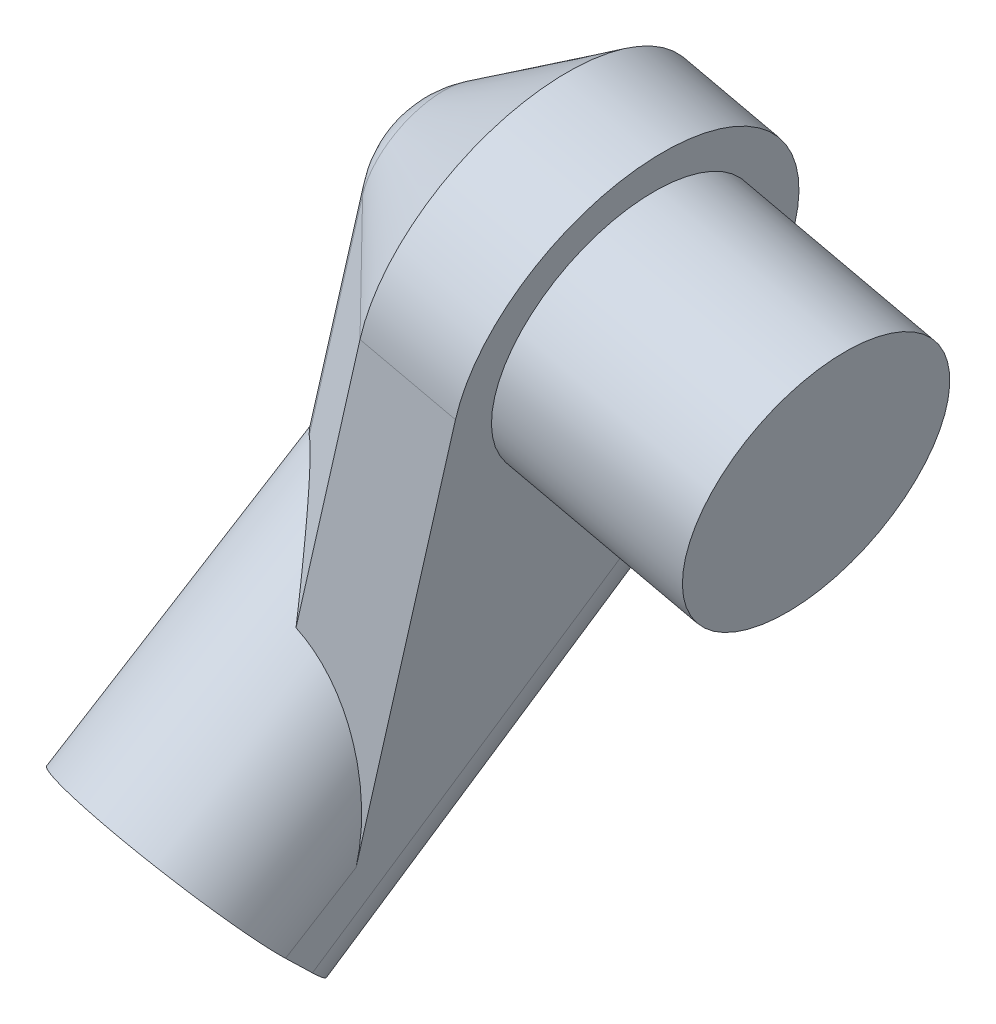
ISO-10303-21;
HEADER;
FILE_DESCRIPTION(('STEP AP214'),'2;1');
FILE_NAME('part.step','',(''),(''),'','','');
FILE_SCHEMA(('AUTOMOTIVE_DESIGN { 1 0 10303 214 1 1 1 1 }'));
ENDSEC;
DATA;
#1=APPLICATION_CONTEXT('core data for automotive mechanical design processes');
#2=APPLICATION_PROTOCOL_DEFINITION('international standard','automotive_design',2000,#1);
#3=PRODUCT_CONTEXT('',#1,'mechanical');
#4=PRODUCT('Part','Part','',(#3));
#5=PRODUCT_RELATED_PRODUCT_CATEGORY('part','',(#4));
#6=PRODUCT_DEFINITION_FORMATION('','',#4);
#7=PRODUCT_DEFINITION_CONTEXT('part definition',#1,'design');
#8=PRODUCT_DEFINITION('design','',#6,#7);
#9=PRODUCT_DEFINITION_SHAPE('','',#8);
#10=(LENGTH_UNIT() NAMED_UNIT(*) SI_UNIT(.MILLI.,.METRE.));
#11=(NAMED_UNIT(*) PLANE_ANGLE_UNIT() SI_UNIT($,.RADIAN.));
#12=(NAMED_UNIT(*) SI_UNIT($,.STERADIAN.) SOLID_ANGLE_UNIT());
#13=UNCERTAINTY_MEASURE_WITH_UNIT(LENGTH_MEASURE(1.E-05),#10,'distance_accuracy_value','');
#14=(GEOMETRIC_REPRESENTATION_CONTEXT(3) GLOBAL_UNCERTAINTY_ASSIGNED_CONTEXT((#13)) GLOBAL_UNIT_ASSIGNED_CONTEXT((#10,
#11,#12)) REPRESENTATION_CONTEXT('',''));
#15=CARTESIAN_POINT('',(0.,0.,0.));
#16=DIRECTION('',(0.,0.,1.));
#17=DIRECTION('',(1.,0.,0.));
#18=AXIS2_PLACEMENT_3D('',#15,#16,#17);
#19=CARTESIAN_POINT('',(-4.30807873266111,20.8127531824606,-0.811195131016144));
#20=DIRECTION('',(-0.156712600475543,-0.689522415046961,0.707106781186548));
#21=DIRECTION('',(0.975131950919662,-0.221625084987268,0.));
#22=AXIS2_PLACEMENT_3D('',#19,#20,#21);
#23=PLANE('',#22);
#24=CARTESIAN_POINT('',(-4.30807873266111,20.8127531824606,-0.811195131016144));
#25=DIRECTION('',(-0.156712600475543,-0.689522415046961,0.707106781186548));
#26=DIRECTION('',(0.156712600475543,0.689522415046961,0.707106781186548));
#27=AXIS2_PLACEMENT_3D('',#24,#25,#26);
#28=CIRCLE('',#27,1.1);
#29=CARTESIAN_POINT('',(-4.13569487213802,21.5712278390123,-0.0333776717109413));
#30=VERTEX_POINT('',#29);
#31=EDGE_CURVE('E256',#30,#30,#28,.T.);
#32=ORIENTED_EDGE('',*,*,#31,.T.);
#33=EDGE_LOOP('',(#32));
#34=FACE_BOUND('',#33,.T.);
#35=ADVANCED_FACE('F17',(#34),#23,.T.);
#36=CARTESIAN_POINT('',(-2.65023585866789,21.7318780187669,-2.13659409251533));
#37=DIRECTION('',(-0.680150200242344,-0.475634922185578,0.557823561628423));
#38=DIRECTION('',(0.573082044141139,-0.819497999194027,0.));
#39=AXIS2_PLACEMENT_3D('',#36,#37,#38);
#40=CYLINDRICAL_SURFACE('',#39,1.5);
#41=CARTESIAN_POINT('',(-5.7262300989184,20.5391610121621,-1.52275017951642));
#42=CARTESIAN_POINT('',(-5.66126643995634,20.3194183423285,-1.6347988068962));
#43=CARTESIAN_POINT('',(-5.55005027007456,20.0901685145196,-1.70019833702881));
#44=CARTESIAN_POINT('',(-5.26277710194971,19.6694235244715,-1.72165114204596));
#45=CARTESIAN_POINT('',(-5.08714943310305,19.4785571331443,-1.67767238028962));
#46=CARTESIAN_POINT('',(-4.90124973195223,19.3308812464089,-1.58435754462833));
#47=(BOUNDED_CURVE() B_SPLINE_CURVE(3,(#41,#42,#43,#44,#45,#46),.UNSPECIFIED.,.F.,
.F.) B_SPLINE_CURVE_WITH_KNOTS((4,2,4),(6.83423118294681,7.34410640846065,7.85398163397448),
.UNSPECIFIED.) CURVE() GEOMETRIC_REPRESENTATION_ITEM() RATIONAL_B_SPLINE_CURVE((1.,1.,1.,1.,1.,1.)) REPRESENTATION_ITEM(''));
#48=CARTESIAN_POINT('',(-4.90124973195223,19.3308812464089,-1.58435754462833));
#49=VERTEX_POINT('',#48);
#50=CARTESIAN_POINT('',(-5.72623009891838,20.539161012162,-1.52275017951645));
#51=VERTEX_POINT('',#50);
#52=EDGE_CURVE('E28',#49,#51,#47,.F.);
#53=ORIENTED_EDGE('',*,*,#52,.T.);
#54=DIRECTION('',(-0.680150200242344,-0.475634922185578,0.557823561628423));
#55=VECTOR('',#54,1.);
#56=CARTESIAN_POINT('',(-3.93211517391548,21.7938011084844,-2.99418924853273));
#57=LINE('',#56,#55);
#58=CARTESIAN_POINT('',(-3.80919735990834,21.8797585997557,-3.095));
#59=VERTEX_POINT('',#58);
#60=EDGE_CURVE('E595',#59,#51,#57,.T.);
#61=ORIENTED_EDGE('',*,*,#60,.F.);
#62=CARTESIAN_POINT('',(-3.54481478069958,20.8524743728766,-3.095));
#63=CARTESIAN_POINT('',(-3.81638535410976,21.0880790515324,-3.095));
#64=CARTESIAN_POINT('',(-3.90811810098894,21.4445155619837,-3.095));
#65=CARTESIAN_POINT('',(-3.80919735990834,21.8797585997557,-3.095));
#66=(BOUNDED_CURVE() B_SPLINE_CURVE(3,(#62,#63,#64,#65),.UNSPECIFIED.,.F.,
.F.) B_SPLINE_CURVE_WITH_KNOTS((4,4),(6.1440687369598,6.83423118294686),
.UNSPECIFIED.) CURVE() GEOMETRIC_REPRESENTATION_ITEM() RATIONAL_B_SPLINE_CURVE((1.,
0.960698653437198,0.960698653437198,1.)) REPRESENTATION_ITEM(''));
#67=CARTESIAN_POINT('',(-3.54481478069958,20.8524743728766,-3.095));
#68=VERTEX_POINT('',#67);
#69=EDGE_CURVE('E236',#68,#59,#66,.T.);
#70=ORIENTED_EDGE('',*,*,#69,.F.);
#71=CARTESIAN_POINT('',(-3.54481478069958,20.8524743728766,-3.095));
#72=CARTESIAN_POINT('',(-3.78985761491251,20.4810584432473,-2.78931375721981));
#73=CARTESIAN_POINT('',(-4.04105594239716,20.1126435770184,-2.44936253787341));
#74=CARTESIAN_POINT('',(-4.2916033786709,19.7572122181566,-2.08435754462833));
#75=(BOUNDED_CURVE() B_SPLINE_CURVE(3,(#71,#72,#73,#74),.UNSPECIFIED.,.F.,
.F.) B_SPLINE_CURVE_WITH_KNOTS((4,4),(1.24120832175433,1.5707963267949),
.UNSPECIFIED.) CURVE() GEOMETRIC_REPRESENTATION_ITEM() RATIONAL_B_SPLINE_CURVE((1.,
0.990968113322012,0.990968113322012,1.)) REPRESENTATION_ITEM(''));
#76=CARTESIAN_POINT('',(-4.2916033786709,19.7572122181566,-2.08435754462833));
#77=VERTEX_POINT('',#76);
#78=EDGE_CURVE('E11',#68,#77,#75,.T.);
#79=ORIENTED_EDGE('',*,*,#78,.T.);
#80=DIRECTION('',(0.680150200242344,0.475634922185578,-0.557823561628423));
#81=VECTOR('',#80,1.);
#82=CARTESIAN_POINT('',(-2.87367028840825,20.748785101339,-3.2472719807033));
#83=LINE('',#82,#81);
#84=EDGE_CURVE('E310',#49,#77,#83,.T.);
#85=ORIENTED_EDGE('',*,*,#84,.F.);
#86=EDGE_LOOP('',(#53,#61,#70,#79,#85));
#87=FACE_BOUND('',#86,.T.);
#88=ADVANCED_FACE('F322',(#87),#40,.T.);
#89=CARTESIAN_POINT('',(-3.8214097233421,21.8260252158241,-1.98432211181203));
#90=DIRECTION('',(0.16410272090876,0.722038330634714,-0.672109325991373));
#91=DIRECTION('',(-0.148956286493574,-0.655395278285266,-0.740451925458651));
#92=AXIS2_PLACEMENT_3D('',#89,#90,#91);
#93=CYLINDRICAL_SURFACE('',#92,1.5);
#94=CARTESIAN_POINT('',(-5.14183235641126,16.0162753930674,1.39789321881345));
#95=CARTESIAN_POINT('',(-4.28500374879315,15.8215379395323,1.39789321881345));
#96=CARTESIAN_POINT('',(-3.58165180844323,16.11275319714,1.83774695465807));
#97=CARTESIAN_POINT('',(-3.44379056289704,16.7193312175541,2.45979407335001));
#98=(BOUNDED_CURVE() B_SPLINE_CURVE(3,(#94,#95,#96,#97),.UNSPECIFIED.,.F.,
.F.) B_SPLINE_CURVE_WITH_KNOTS((4,4),(3.1415926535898,4.71238898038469),
.UNSPECIFIED.) CURVE() GEOMETRIC_REPRESENTATION_ITEM() RATIONAL_B_SPLINE_CURVE((1.,
0.804737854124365,0.804737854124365,1.)) REPRESENTATION_ITEM(''));
#99=CARTESIAN_POINT('',(-5.14183235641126,16.0162753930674,1.39789321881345));
#100=VERTEX_POINT('',#99);
#101=CARTESIAN_POINT('',(-3.44379056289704,16.7193312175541,2.45979407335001));
#102=VERTEX_POINT('',#101);
#103=EDGE_CURVE('E267',#100,#102,#98,.T.);
#104=ORIENTED_EDGE('',*,*,#103,.F.);
#105=DIRECTION('',(-0.16410272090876,-0.722038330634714,0.672109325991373));
#106=VECTOR('',#105,1.);
#107=CARTESIAN_POINT('',(-5.14183235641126,16.0162753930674,1.39789321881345));
#108=LINE('',#107,#106);
#109=EDGE_CURVE('E543',#77,#100,#108,.T.);
#110=ORIENTED_EDGE('',*,*,#109,.F.);
#111=ORIENTED_EDGE('',*,*,#78,.F.);
#112=CARTESIAN_POINT('',(-2.08752784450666,22.686774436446,-3.095));
#113=CARTESIAN_POINT('',(-2.30650603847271,21.7232885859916,-3.095));
#114=CARTESIAN_POINT('',(-2.86122879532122,21.0250541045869,-3.095));
#115=CARTESIAN_POINT('',(-3.54481478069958,20.8524743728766,-3.095));
#116=(BOUNDED_CURVE() B_SPLINE_CURVE(3,(#112,#113,#114,#115),.UNSPECIFIED.,.F.,
.F.) B_SPLINE_CURVE_WITH_KNOTS((4,4),(1.5707963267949,2.81200464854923),
.UNSPECIFIED.) CURVE() GEOMETRIC_REPRESENTATION_ITEM() RATIONAL_B_SPLINE_CURVE((1.,
0.875684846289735,0.875684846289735,1.)) REPRESENTATION_ITEM(''));
#117=CARTESIAN_POINT('',(-2.08752784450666,22.686774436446,-3.095));
#118=VERTEX_POINT('',#117);
#119=EDGE_CURVE('E231',#118,#68,#116,.T.);
#120=ORIENTED_EDGE('',*,*,#119,.F.);
#121=DIRECTION('',(0.16410272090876,0.722038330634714,-0.672109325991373));
#122=VECTOR('',#121,1.);
#123=CARTESIAN_POINT('',(-2.35871179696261,21.4935875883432,-1.98432211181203));
#124=LINE('',#123,#122);
#125=EDGE_CURVE('E214',#102,#118,#124,.T.);
#126=ORIENTED_EDGE('',*,*,#125,.F.);
#127=EDGE_LOOP('',(#104,#110,#111,#120,#126));
#128=FACE_BOUND('',#127,.T.);
#129=ADVANCED_FACE('F19',(#128),#93,.T.);
#130=CARTESIAN_POINT('',(-5.7262300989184,20.5391610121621,-1.52275017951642));
#131=CARTESIAN_POINT('',(-5.95654152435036,20.3184309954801,-1.34708545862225));
#132=CARTESIAN_POINT('',(-6.03757685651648,20.0974785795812,-1.06917091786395));
#133=CARTESIAN_POINT('',(-5.66126643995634,20.3194183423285,-1.6347988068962));
#134=CARTESIAN_POINT('',(-5.85406110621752,20.1103337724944,-1.47937973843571));
#135=CARTESIAN_POINT('',(-5.94007789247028,19.923891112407,-1.228617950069));
#136=CARTESIAN_POINT('',(-5.55005027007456,20.0901685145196,-1.70019833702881));
#137=CARTESIAN_POINT('',(-5.6966543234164,19.9118025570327,-1.56465625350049));
#138=CARTESIAN_POINT('',(-5.78261834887,19.7602430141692,-1.36138620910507));
#139=CARTESIAN_POINT('',(-5.26277710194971,19.6694235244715,-1.72165114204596));
#140=CARTESIAN_POINT('',(-5.32873003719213,19.5748799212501,-1.64019051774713));
#141=CARTESIAN_POINT('',(-5.38692857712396,19.4932998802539,-1.54078356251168));
#142=CARTESIAN_POINT('',(-5.08714943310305,19.4785571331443,-1.67767238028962));
#143=CARTESIAN_POINT('',(-5.11778244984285,19.4342716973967,-1.63231170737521));
#144=CARTESIAN_POINT('',(-5.14928970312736,19.3904037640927,-1.58714457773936));
#145=CARTESIAN_POINT('',(-4.90124973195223,19.3308812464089,-1.58435754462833));
#146=CARTESIAN_POINT('',(-4.90124973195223,19.3308812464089,-1.58435754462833));
#147=CARTESIAN_POINT('',(-4.90124973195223,19.3308812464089,-1.58435754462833));
#148=(BOUNDED_SURFACE() B_SPLINE_SURFACE(3,2,((#130,#131,#132),(#133,#134,#135),(#136,#137,
#138),(#139,#140,#141),(#142,#143,#144),(#145,#146,#147)),.UNSPECIFIED.,.F.,.F.,
.F.) B_SPLINE_SURFACE_WITH_KNOTS((4,2,4),(3,3),(6.83423118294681,7.34410640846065,
7.85398163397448),(0.,1.),
.UNSPECIFIED.) GEOMETRIC_REPRESENTATION_ITEM() RATIONAL_B_SPLINE_SURFACE(((1.,0.968652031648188,
1.),(1.,0.97531957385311,1.),(1.,0.983603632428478,1.),(1.,0.996040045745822,1.),(1.,
1.00010066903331,1.),(1.,1.,1.))) REPRESENTATION_ITEM('') SURFACE());
#149=CARTESIAN_POINT('',(-4.90124973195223,19.3308812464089,-1.58435754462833));
#150=CARTESIAN_POINT('',(-5.14928970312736,19.3904037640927,-1.58714457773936));
#151=CARTESIAN_POINT('',(-5.38692857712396,19.4932998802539,-1.54078356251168));
#152=CARTESIAN_POINT('',(-5.78261834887,19.7602430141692,-1.36138620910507));
#153=CARTESIAN_POINT('',(-5.94007789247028,19.923891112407,-1.228617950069));
#154=CARTESIAN_POINT('',(-6.03757685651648,20.0974785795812,-1.06917091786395));
#155=(BOUNDED_CURVE() B_SPLINE_CURVE(3,(#149,#150,#151,#152,#153,#154),.UNSPECIFIED.,.F.,
.F.) B_SPLINE_CURVE_WITH_KNOTS((4,2,4),(6.83423118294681,7.34410640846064,7.85398163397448),
.UNSPECIFIED.) CURVE() GEOMETRIC_REPRESENTATION_ITEM() RATIONAL_B_SPLINE_CURVE((1.,1.,1.,1.,1.,1.)) REPRESENTATION_ITEM(''));
#156=CARTESIAN_POINT('',(-6.03757685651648,20.0974785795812,-1.06917091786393));
#157=VERTEX_POINT('',#156);
#158=EDGE_CURVE('E43',#49,#157,#155,.T.);
#159=CARTESIAN_POINT('',(-4.7471082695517,20.3166291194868,-0.518658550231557));
#160=DIRECTION('',(0.352992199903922,-0.779789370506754,-0.517034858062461));
#161=DIRECTION('',(0.911006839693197,0.412391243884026,0.));
#162=AXIS2_PLACEMENT_3D('',#159,#160,#161);
#163=CIRCLE('',#162,1.42);
#164=EDGE_CURVE('E623',#157,#51,#163,.T.);
#165=ORIENTED_EDGE('',*,*,#158,.T.);
#166=ORIENTED_EDGE('',*,*,#164,.T.);
#167=ORIENTED_EDGE('',*,*,#52,.F.);
#168=EDGE_LOOP('',(#165,#166,#167));
#169=FACE_BOUND('',#168,.T.);
#170=ADVANCED_FACE('F354',(#169),#148,.T.);
#171=CARTESIAN_POINT('',(-4.06109784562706,23.0274797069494,-2.99954608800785));
#172=DIRECTION('',(-0.16410272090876,-0.722038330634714,0.672109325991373));
#173=DIRECTION('',(0.148956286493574,0.655395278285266,0.740451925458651));
#174=AXIS2_PLACEMENT_3D('',#171,#172,#173);
#175=CYLINDRICAL_SURFACE('',#174,1.5);
#176=DIRECTION('',(-0.16410272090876,-0.722038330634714,0.672109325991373));
#177=VECTOR('',#176,1.);
#178=CARTESIAN_POINT('',(-5.52379577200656,23.3599173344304,-2.99954608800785));
#179=LINE('',#178,#177);
#180=CARTESIAN_POINT('',(-6.13242245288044,20.682010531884,-0.506816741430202));
#181=VERTEX_POINT('',#180);
#182=CARTESIAN_POINT('',(-6.85675239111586,17.4950190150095,2.45979407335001));
#183=VERTEX_POINT('',#182);
#184=EDGE_CURVE('E477',#181,#183,#179,.T.);
#185=ORIENTED_EDGE('',*,*,#184,.F.);
#186=CARTESIAN_POINT('',(-6.03757685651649,20.0974785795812,-1.06917091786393));
#187=CARTESIAN_POINT('',(-6.14309994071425,20.2853522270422,-0.896601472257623));
#188=CARTESIAN_POINT('',(-6.17620457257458,20.4893728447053,-0.700321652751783));
#189=CARTESIAN_POINT('',(-6.13242245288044,20.682010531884,-0.506816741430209));
#190=(BOUNDED_CURVE() B_SPLINE_CURVE(3,(#186,#187,#188,#189),.UNSPECIFIED.,.F.,
.F.) B_SPLINE_CURVE_WITH_KNOTS((4,4),(5.64582302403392,6.19686889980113),
.UNSPECIFIED.) CURVE() GEOMETRIC_REPRESENTATION_ITEM() RATIONAL_B_SPLINE_CURVE((1.,1.,1.,1.)) REPRESENTATION_ITEM(''));
#191=EDGE_CURVE('E164',#181,#157,#190,.F.);
#192=ORIENTED_EDGE('',*,*,#191,.T.);
#193=ORIENTED_EDGE('',*,*,#158,.F.);
#194=DIRECTION('',(0.16410272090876,0.722038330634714,-0.672109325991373));
#195=VECTOR('',#194,1.);
#196=CARTESIAN_POINT('',(-4.53241012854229,20.9537448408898,-3.095));
#197=LINE('',#196,#195);
#198=CARTESIAN_POINT('',(-5.62939833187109,16.1270879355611,1.39789321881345));
#199=VERTEX_POINT('',#198);
#200=EDGE_CURVE('E237',#199,#49,#197,.T.);
#201=ORIENTED_EDGE('',*,*,#200,.F.);
#202=CARTESIAN_POINT('',(-6.85675239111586,17.4950190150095,2.45979407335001));
#203=CARTESIAN_POINT('',(-6.99461363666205,16.8884409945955,1.83774695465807));
#204=CARTESIAN_POINT('',(-6.48622693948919,16.3218253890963,1.39789321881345));
#205=CARTESIAN_POINT('',(-5.62939833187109,16.1270879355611,1.39789321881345));
#206=(BOUNDED_CURVE() B_SPLINE_CURVE(3,(#202,#203,#204,#205),.UNSPECIFIED.,.F.,
.F.) B_SPLINE_CURVE_WITH_KNOTS((4,4),(4.71238898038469,6.28318530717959),
.UNSPECIFIED.) CURVE() GEOMETRIC_REPRESENTATION_ITEM() RATIONAL_B_SPLINE_CURVE((1.,
0.804737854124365,0.804737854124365,1.)) REPRESENTATION_ITEM(''));
#207=EDGE_CURVE('E271',#183,#199,#206,.T.);
#208=ORIENTED_EDGE('',*,*,#207,.F.);
#209=EDGE_LOOP('',(#185,#192,#193,#201,#208));
#210=FACE_BOUND('',#209,.T.);
#211=ADVANCED_FACE('F359',(#210),#175,.T.);
#212=CARTESIAN_POINT('',(-5.7268569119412,20.5898348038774,-1.5109083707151));
#213=CARTESIAN_POINT('',(-6.13242245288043,20.682010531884,-1.095));
#214=CARTESIAN_POINT('',(-6.13242245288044,20.682010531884,-0.506816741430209));
#215=CARTESIAN_POINT('',(-5.73171908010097,20.5684416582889,-1.51090837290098));
#216=CARTESIAN_POINT('',(-6.08343588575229,20.5467376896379,-1.17274822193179));
#217=CARTESIAN_POINT('',(-6.17620457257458,20.4893728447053,-0.700321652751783));
#218=CARTESIAN_POINT('',(-5.73149629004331,20.5507944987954,-1.51503667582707));
#219=CARTESIAN_POINT('',(-6.02435022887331,20.4241802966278,-1.25752632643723));
#220=CARTESIAN_POINT('',(-6.14309994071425,20.2853522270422,-0.896601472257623));
#221=CARTESIAN_POINT('',(-5.72623009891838,20.539161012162,-1.52275017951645));
#222=CARTESIAN_POINT('',(-5.95654152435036,20.3184309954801,-1.34708545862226));
#223=CARTESIAN_POINT('',(-6.03757685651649,20.0974785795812,-1.06917091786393));
#224=(BOUNDED_SURFACE() B_SPLINE_SURFACE(3,2,((#212,#213,#214),(#215,#216,#217),(#218,#219,
#220),(#221,#222,#223)),.UNSPECIFIED.,.F.,.F.,.F.) B_SPLINE_SURFACE_WITH_KNOTS((4,4),(3,3),
(5.64582302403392,6.19686889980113),(0.,1.),
.UNSPECIFIED.) GEOMETRIC_REPRESENTATION_ITEM() RATIONAL_B_SPLINE_SURFACE(((1.,0.923879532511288,
1.),(1.,0.949922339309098,1.),(1.,0.965074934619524,1.),(1.,0.968652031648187,1.))) REPRESENTATION_ITEM('') SURFACE());
#225=CARTESIAN_POINT('',(-4.74773508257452,20.3673029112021,-0.506816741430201));
#226=DIRECTION('',(0.221625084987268,0.975131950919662,0.));
#227=DIRECTION('',(-0.975131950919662,0.221625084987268,0.));
#228=AXIS2_PLACEMENT_3D('',#225,#226,#227);
#229=CIRCLE('',#228,1.42);
#230=CARTESIAN_POINT('',(-5.7268569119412,20.5898348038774,-1.5109083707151));
#231=VERTEX_POINT('',#230);
#232=EDGE_CURVE('E294',#231,#181,#229,.T.);
#233=CARTESIAN_POINT('',(-5.72623009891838,20.539161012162,-1.52275017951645));
#234=CARTESIAN_POINT('',(-5.73155038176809,20.5509139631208,-1.51495745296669));
#235=CARTESIAN_POINT('',(-5.73176470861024,20.5682409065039,-1.5109083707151));
#236=CARTESIAN_POINT('',(-5.7268569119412,20.5898348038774,-1.5109083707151));
#237=(BOUNDED_CURVE() B_SPLINE_CURVE(3,(#233,#234,#235,#236),.UNSPECIFIED.,.F.,
.F.) B_SPLINE_CURVE_WITH_KNOTS((4,4),(0.0863164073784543,0.63736228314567),
.UNSPECIFIED.) CURVE() GEOMETRIC_REPRESENTATION_ITEM() RATIONAL_B_SPLINE_CURVE((1.,
0.974855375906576,0.974855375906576,1.)) REPRESENTATION_ITEM(''));
#238=EDGE_CURVE('E295',#51,#231,#237,.T.);
#239=ORIENTED_EDGE('',*,*,#191,.F.);
#240=ORIENTED_EDGE('',*,*,#232,.F.);
#241=ORIENTED_EDGE('',*,*,#238,.F.);
#242=ORIENTED_EDGE('',*,*,#164,.F.);
#243=EDGE_LOOP('',(#239,#240,#241,#242));
#244=FACE_BOUND('',#243,.T.);
#245=ADVANCED_FACE('F396',(#244),#224,.T.);
#246=CARTESIAN_POINT('',(-3.63527031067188,25.2620554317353,-0.483183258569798));
#247=DIRECTION('',(-0.221625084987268,-0.975131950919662,0.));
#248=DIRECTION('',(0.975131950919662,-0.221625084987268,0.));
#249=AXIS2_PLACEMENT_3D('',#246,#247,#248);
#250=CYLINDRICAL_SURFACE('',#249,1.42);
#251=CARTESIAN_POINT('',(-5.43198830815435,21.8872321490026,0.5209083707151));
#252=CARTESIAN_POINT('',(-5.44900288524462,21.8807514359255,0.505752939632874));
#253=CARTESIAN_POINT('',(-5.46567081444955,21.8741032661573,0.49028078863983));
#254=CARTESIAN_POINT('',(-5.49882342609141,21.8602511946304,0.458235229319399));
#255=CARTESIAN_POINT('',(-5.51528472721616,21.8530362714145,0.441642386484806));
#256=CARTESIAN_POINT('',(-5.54793622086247,21.8380159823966,0.407341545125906));
#257=CARTESIAN_POINT('',(-5.56410153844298,21.8301991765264,0.389614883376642));
#258=CARTESIAN_POINT('',(-5.59606778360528,21.813943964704,0.353035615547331));
#259=CARTESIAN_POINT('',(-5.61184231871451,21.8054938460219,0.334165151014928));
#260=CARTESIAN_POINT('',(-5.64292798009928,21.7879439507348,0.295291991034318));
#261=CARTESIAN_POINT('',(-5.65821116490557,21.7788323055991,0.275272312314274));
#262=CARTESIAN_POINT('',(-5.68820995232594,21.7599342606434,0.234099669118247));
#263=CARTESIAN_POINT('',(-5.70289605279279,21.7501359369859,0.212930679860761));
#264=CARTESIAN_POINT('',(-5.73159007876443,21.7298468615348,0.169462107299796));
#265=CARTESIAN_POINT('',(-5.74556689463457,21.7193443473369,0.147147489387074));
#266=CARTESIAN_POINT('',(-5.77273123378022,21.6976217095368,0.101402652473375));
#267=CARTESIAN_POINT('',(-5.7858861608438,21.6863897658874,0.0779586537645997));
#268=CARTESIAN_POINT('',(-5.80641069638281,21.6676715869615,0.0391471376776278));
#269=CARTESIAN_POINT('',(-5.8141535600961,21.6602979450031,0.023921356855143));
#270=CARTESIAN_POINT('',(-5.83001175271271,21.6445107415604,-0.0085260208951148));
#271=CARTESIAN_POINT('',(-5.83806214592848,21.6360776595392,-0.0257699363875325));
#272=CARTESIAN_POINT('',(-5.85433928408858,21.6180928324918,-0.0622806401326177));
#273=CARTESIAN_POINT('',(-5.86249402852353,21.6085173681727,-0.0815678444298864));
#274=CARTESIAN_POINT('',(-5.87875531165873,21.5881764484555,-0.122190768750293));
#275=CARTESIAN_POINT('',(-5.88678209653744,21.5773849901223,-0.143545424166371));
#276=CARTESIAN_POINT('',(-5.90253649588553,21.5545417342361,-0.188317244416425));
#277=CARTESIAN_POINT('',(-5.91017633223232,21.5424623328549,-0.211751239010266));
#278=CARTESIAN_POINT('',(-5.92487822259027,21.5169805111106,-0.26068304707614));
#279=CARTESIAN_POINT('',(-5.93184418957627,21.5035498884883,-0.28619507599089));
#280=CARTESIAN_POINT('',(-5.94489218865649,21.4753132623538,-0.339266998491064));
#281=CARTESIAN_POINT('',(-5.95086963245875,21.4604793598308,-0.366837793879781));
#282=CARTESIAN_POINT('',(-5.96160860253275,21.4294002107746,-0.423990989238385));
#283=CARTESIAN_POINT('',(-5.96625701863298,21.4131284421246,-0.453580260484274));
#284=CARTESIAN_POINT('',(-5.96999582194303,21.3966742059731,-0.483183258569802));
#285=B_SPLINE_CURVE_WITH_KNOTS('',3,(#251,#252,#253,#254,#255,#256,#257,#258,#259,#260,#261,
#262,#263,#264,#265,#266,#267,#268,#269,#270,#271,#272,#273,#274,#275,#276,#277,#278,#279,#280,
#281,#282,#283,#284),.UNSPECIFIED.,.F.,.F.,(4,2,2,2,2,2,2,2,2,2,2,2,2,2,2,2,4),(0.,
0.0710619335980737,0.14442327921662,0.220095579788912,0.298089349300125,0.378414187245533,
0.461078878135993,0.546091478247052,0.633459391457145,0.689266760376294,0.751700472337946,
0.82076192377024,0.896452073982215,0.978771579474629,1.06772087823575,1.16330024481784,
1.2655098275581),.UNSPECIFIED.);
#286=CARTESIAN_POINT('',(-5.43198830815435,21.8872321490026,0.520908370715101));
#287=VERTEX_POINT('',#286);
#288=CARTESIAN_POINT('',(-5.96999582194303,21.3966742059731,-0.483183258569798));
#289=VERTEX_POINT('',#288);
#290=EDGE_CURVE('E150',#287,#289,#285,.T.);
#291=ORIENTED_EDGE('',*,*,#290,.F.);
#292=DIRECTION('',(-0.221625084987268,-0.975131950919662,0.));
#293=VECTOR('',#292,1.);
#294=CARTESIAN_POINT('',(-4.61439214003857,25.4845873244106,0.520908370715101));
#295=LINE('',#294,#293);
#296=CARTESIAN_POINT('',(-4.61439214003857,25.4845873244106,0.520908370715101));
#297=VERTEX_POINT('',#296);
#298=EDGE_CURVE('E251',#297,#287,#295,.T.);
#299=ORIENTED_EDGE('',*,*,#298,.F.);
#300=CARTESIAN_POINT('',(-3.63527031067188,25.2620554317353,-0.483183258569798));
#301=DIRECTION('',(-0.221625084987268,-0.975131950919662,0.));
#302=DIRECTION('',(0.975131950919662,-0.221625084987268,0.));
#303=AXIS2_PLACEMENT_3D('',#300,#301,#302);
#304=CIRCLE('',#303,1.42);
#305=CARTESIAN_POINT('',(-5.0199576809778,25.5767630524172,-0.483183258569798));
#306=VERTEX_POINT('',#305);
#307=EDGE_CURVE('E296',#297,#306,#304,.T.);
#308=ORIENTED_EDGE('',*,*,#307,.T.);
#309=DIRECTION('',(0.221625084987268,0.975131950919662,0.));
#310=VECTOR('',#309,1.);
#311=CARTESIAN_POINT('',(-5.0199576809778,25.5767630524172,-0.483183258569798));
#312=LINE('',#311,#310);
#313=EDGE_CURVE('E246',#289,#306,#312,.T.);
#314=ORIENTED_EDGE('',*,*,#313,.F.);
#315=EDGE_LOOP('',(#291,#299,#308,#314));
#316=FACE_BOUND('',#315,.T.);
#317=ADVANCED_FACE('F332',(#316),#250,.T.);
#318=CARTESIAN_POINT('',(-3.63527031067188,25.2620554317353,-0.495));
#319=DIRECTION('',(-0.975131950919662,0.221625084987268,0.));
#320=DIRECTION('',(0.,0.,1.));
#321=AXIS2_PLACEMENT_3D('',#318,#319,#320);
#322=DEGENERATE_TOROIDAL_SURFACE('',#321,0.0118167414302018,1.42,.T.);
#323=CARTESIAN_POINT('',(-3.63527031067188,25.2620554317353,-0.506816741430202));
#324=DIRECTION('',(0.221625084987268,0.975131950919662,0.));
#325=DIRECTION('',(-0.975131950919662,0.221625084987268,0.));
#326=AXIS2_PLACEMENT_3D('',#323,#324,#325);
#327=CIRCLE('',#326,1.42);
#328=CARTESIAN_POINT('',(-4.61439214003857,25.4845873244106,-1.5109083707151));
#329=VERTEX_POINT('',#328);
#330=CARTESIAN_POINT('',(-5.0199576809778,25.5767630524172,-0.506816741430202));
#331=VERTEX_POINT('',#330);
#332=EDGE_CURVE('E298',#329,#331,#327,.T.);
#333=ORIENTED_EDGE('',*,*,#332,.T.);
#334=CARTESIAN_POINT('',(-5.0199576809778,25.5767630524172,-0.495));
#335=DIRECTION('',(-0.975131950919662,0.221625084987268,0.));
#336=DIRECTION('',(0.,0.,1.));
#337=AXIS2_PLACEMENT_3D('',#334,#335,#336);
#338=CIRCLE('',#337,0.0118167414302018);
#339=EDGE_CURVE('E238',#306,#331,#338,.T.);
#340=ORIENTED_EDGE('',*,*,#339,.F.);
#341=ORIENTED_EDGE('',*,*,#307,.F.);
#342=CARTESIAN_POINT('',(-4.61439214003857,25.4845873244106,-0.495));
#343=DIRECTION('',(0.975131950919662,-0.221625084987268,0.));
#344=DIRECTION('',(0.,0.,1.));
#345=AXIS2_PLACEMENT_3D('',#342,#343,#344);
#346=CIRCLE('',#345,1.0159083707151);
#347=EDGE_CURVE('E250',#329,#297,#346,.T.);
#348=ORIENTED_EDGE('',*,*,#347,.F.);
#349=EDGE_LOOP('',(#333,#340,#341,#348));
#350=FACE_BOUND('',#349,.T.);
#351=ADVANCED_FACE('F346',(#350),#322,.T.);
#352=CARTESIAN_POINT('',(-3.63527031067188,25.2620554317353,-0.506816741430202));
#353=DIRECTION('',(0.221625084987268,0.975131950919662,0.));
#354=DIRECTION('',(0.,0.,-1.));
#355=AXIS2_PLACEMENT_3D('',#352,#353,#354);
#356=CYLINDRICAL_SURFACE('',#355,1.42);
#357=DIRECTION('',(0.221625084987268,0.975131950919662,0.));
#358=VECTOR('',#357,1.);
#359=CARTESIAN_POINT('',(-4.61439214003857,25.4845873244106,-1.5109083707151));
#360=LINE('',#359,#358);
#361=EDGE_CURVE('E290',#231,#329,#360,.T.);
#362=ORIENTED_EDGE('',*,*,#361,.F.);
#363=ORIENTED_EDGE('',*,*,#232,.T.);
#364=DIRECTION('',(-0.221625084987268,-0.975131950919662,0.));
#365=VECTOR('',#364,1.);
#366=CARTESIAN_POINT('',(-5.0199576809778,25.5767630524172,-0.506816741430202));
#367=LINE('',#366,#365);
#368=EDGE_CURVE('E289',#331,#181,#367,.T.);
#369=ORIENTED_EDGE('',*,*,#368,.F.);
#370=ORIENTED_EDGE('',*,*,#332,.F.);
#371=EDGE_LOOP('',(#362,#363,#369,#370));
#372=FACE_BOUND('',#371,.T.);
#373=ADVANCED_FACE('F349',(#372),#356,.T.);
#374=CARTESIAN_POINT('',(-5.0199576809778,25.5767630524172,-1.095));
#375=DIRECTION('',(0.68952241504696,-0.156712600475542,0.707106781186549));
#376=DIRECTION('',(-0.221625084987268,-0.975131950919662,0.));
#377=AXIS2_PLACEMENT_3D('',#374,#375,#376);
#378=PLANE('',#377);
#379=DIRECTION('',(0.221625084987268,0.975131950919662,0.));
#380=VECTOR('',#379,1.);
#381=CARTESIAN_POINT('',(-3.06969377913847,25.1335128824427,-3.095));
#382=LINE('',#381,#380);
#383=CARTESIAN_POINT('',(-3.06969377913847,25.1335128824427,-3.095));
#384=VERTEX_POINT('',#383);
#385=EDGE_CURVE('E192',#59,#384,#382,.T.);
#386=ORIENTED_EDGE('',*,*,#385,.F.);
#387=ORIENTED_EDGE('',*,*,#60,.T.);
#388=ORIENTED_EDGE('',*,*,#238,.T.);
#389=ORIENTED_EDGE('',*,*,#361,.T.);
#390=DIRECTION('',(0.689522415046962,-0.156712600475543,-0.707106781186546));
#391=VECTOR('',#390,1.);
#392=CARTESIAN_POINT('',(-5.0199576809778,25.5767630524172,-1.095));
#393=LINE('',#392,#391);
#394=EDGE_CURVE('E247',#329,#384,#393,.T.);
#395=ORIENTED_EDGE('',*,*,#394,.T.);
#396=EDGE_LOOP('',(#386,#387,#388,#389,#395));
#397=FACE_BOUND('',#396,.T.);
#398=ADVANCED_FACE('F352',(#397),#378,.F.);
#399=CARTESIAN_POINT('',(-5.0199576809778,25.5767630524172,-0.495));
#400=DIRECTION('',(0.975131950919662,-0.221625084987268,0.));
#401=DIRECTION('',(0.,0.,-1.));
#402=AXIS2_PLACEMENT_3D('',#399,#400,#401);
#403=CONICAL_SURFACE('',#402,0.6,0.785398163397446);
#404=ORIENTED_EDGE('',*,*,#394,.F.);
#405=ORIENTED_EDGE('',*,*,#347,.T.);
#406=DIRECTION('',(0.689522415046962,-0.156712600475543,0.707106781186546));
#407=VECTOR('',#406,1.);
#408=CARTESIAN_POINT('',(-5.0199576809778,25.5767630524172,0.104999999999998));
#409=LINE('',#408,#407);
#410=CARTESIAN_POINT('',(-3.06969377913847,25.1335128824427,2.105));
#411=VERTEX_POINT('',#410);
#412=EDGE_CURVE('E458',#297,#411,#409,.T.);
#413=ORIENTED_EDGE('',*,*,#412,.T.);
#414=CARTESIAN_POINT('',(-3.06969377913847,25.1335128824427,-0.495));
#415=DIRECTION('',(0.975131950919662,-0.221625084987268,0.));
#416=DIRECTION('',(0.,0.,1.));
#417=AXIS2_PLACEMENT_3D('',#414,#415,#416);
#418=CIRCLE('',#417,2.6);
#419=EDGE_CURVE('E197',#384,#411,#418,.T.);
#420=ORIENTED_EDGE('',*,*,#419,.F.);
#421=EDGE_LOOP('',(#404,#405,#413,#420));
#422=FACE_BOUND('',#421,.T.);
#423=ADVANCED_FACE('F581',(#422),#403,.T.);
#424=CARTESIAN_POINT('',(-5.0199576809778,25.5767630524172,0.104999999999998));
#425=DIRECTION('',(0.689522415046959,-0.156712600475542,-0.707106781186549));
#426=DIRECTION('',(-0.689522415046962,0.156712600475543,-0.707106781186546));
#427=AXIS2_PLACEMENT_3D('',#424,#425,#426);
#428=PLANE('',#427);
#429=ORIENTED_EDGE('',*,*,#412,.F.);
#430=ORIENTED_EDGE('',*,*,#298,.T.);
#431=CARTESIAN_POINT('',(-4.23322086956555,21.1421215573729,1.855));
#432=CARTESIAN_POINT('',(-4.62671061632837,21.7670815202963,1.33278877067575));
#433=CARTESIAN_POINT('',(-5.05255496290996,22.0317710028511,0.858872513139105));
#434=CARTESIAN_POINT('',(-5.43198830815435,21.8872321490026,0.520908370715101));
#435=(BOUNDED_CURVE() B_SPLINE_CURVE(3,(#431,#432,#433,#434),.UNSPECIFIED.,.F.,
.F.) B_SPLINE_CURVE_WITH_KNOTS((4,4),(5.32786868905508,6.19478687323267),
.UNSPECIFIED.) CURVE() GEOMETRIC_REPRESENTATION_ITEM() RATIONAL_B_SPLINE_CURVE((1.,
0.938345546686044,0.938345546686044,1.)) REPRESENTATION_ITEM(''));
#436=CARTESIAN_POINT('',(-4.23322086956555,21.1421215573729,1.855));
#437=VERTEX_POINT('',#436);
#438=EDGE_CURVE('E283',#437,#287,#435,.T.);
#439=ORIENTED_EDGE('',*,*,#438,.F.);
#440=CARTESIAN_POINT('',(-4.05046988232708,20.8181795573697,2.105));
#441=CARTESIAN_POINT('',(-4.10913761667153,20.9337978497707,2.0221673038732));
#442=CARTESIAN_POINT('',(-4.17015905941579,21.0419636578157,1.93869108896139));
#443=CARTESIAN_POINT('',(-4.23322086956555,21.1421215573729,1.855));
#444=(BOUNDED_CURVE() B_SPLINE_CURVE(3,(#440,#441,#442,#443),.UNSPECIFIED.,.F.,
.F.) B_SPLINE_CURVE_WITH_KNOTS((4,4),(2.04292846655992,2.18627603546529),
.UNSPECIFIED.) CURVE() GEOMETRIC_REPRESENTATION_ITEM() RATIONAL_B_SPLINE_CURVE((1.,
0.998288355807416,0.998288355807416,1.)) REPRESENTATION_ITEM(''));
#445=CARTESIAN_POINT('',(-4.05046988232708,20.8181795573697,2.105));
#446=VERTEX_POINT('',#445);
#447=EDGE_CURVE('E245',#446,#437,#444,.T.);
#448=ORIENTED_EDGE('',*,*,#447,.F.);
#449=DIRECTION('',(-0.221625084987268,-0.975131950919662,0.));
#450=VECTOR('',#449,1.);
#451=CARTESIAN_POINT('',(-3.06969377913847,25.1335128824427,2.105));
#452=LINE('',#451,#450);
#453=EDGE_CURVE('E516',#411,#446,#452,.T.);
#454=ORIENTED_EDGE('',*,*,#453,.F.);
#455=EDGE_LOOP('',(#429,#430,#439,#448,#454));
#456=FACE_BOUND('',#455,.T.);
#457=ADVANCED_FACE('F339',(#456),#428,.F.);
#458=CARTESIAN_POINT('',(1.3184,24.1362,-0.495));
#459=DIRECTION('',(0.975131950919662,-0.221625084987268,0.));
#460=DIRECTION('',(-0.221625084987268,-0.975131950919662,0.));
#461=AXIS2_PLACEMENT_3D('',#458,#459,#460);
#462=PLANE('',#461);
#463=CARTESIAN_POINT('',(1.3184,24.1362,-0.495));
#464=DIRECTION('',(0.975131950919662,-0.221625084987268,0.));
#465=DIRECTION('',(0.,0.,-1.));
#466=AXIS2_PLACEMENT_3D('',#463,#464,#465);
#467=CIRCLE('',#466,2.);
#468=CARTESIAN_POINT('',(1.3184,24.1362,1.505));
#469=VERTEX_POINT('',#468);
#470=EDGE_CURVE('E274',#469,#469,#467,.T.);
#471=ORIENTED_EDGE('',*,*,#470,.T.);
#472=EDGE_LOOP('',(#471));
#473=FACE_BOUND('',#472,.T.);
#474=ADVANCED_FACE('F335',(#473),#462,.T.);
#475=CARTESIAN_POINT('',(-3.78718639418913,23.1046361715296,-2.63243686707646));
#476=DIRECTION('',(0.156712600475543,0.689522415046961,-0.707106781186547));
#477=DIRECTION('',(-0.156712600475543,-0.68952241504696,-0.707106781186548));
#478=AXIS2_PLACEMENT_3D('',#475,#476,#477);
#479=CYLINDRICAL_SURFACE('',#478,1.75);
#480=DIRECTION('',(0.156712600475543,0.689522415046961,-0.707106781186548));
#481=VECTOR('',#480,1.);
#482=CARTESIAN_POINT('',(-5.49366730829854,23.4924800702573,-2.63243686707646));
#483=LINE('',#482,#481);
#484=CARTESIAN_POINT('',(-6.73949290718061,18.0109509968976,2.98888347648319));
#485=VERTEX_POINT('',#484);
#486=EDGE_CURVE('E473',#485,#289,#483,.T.);
#487=ORIENTED_EDGE('',*,*,#486,.F.);
#488=CARTESIAN_POINT('',(-5.0330119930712,17.6231070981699,2.98888347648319));
#489=DIRECTION('',(-0.156712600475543,-0.689522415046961,0.707106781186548));
#490=DIRECTION('',(0.156712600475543,0.689522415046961,0.707106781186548));
#491=AXIS2_PLACEMENT_3D('',#488,#489,#490);
#492=CIRCLE('',#491,1.75);
#493=CARTESIAN_POINT('',(-3.32653107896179,17.2352631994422,2.98888347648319));
#494=VERTEX_POINT('',#493);
#495=EDGE_CURVE('E263',#494,#485,#492,.T.);
#496=ORIENTED_EDGE('',*,*,#495,.F.);
#497=DIRECTION('',(-0.156712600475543,-0.689522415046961,0.707106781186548));
#498=VECTOR('',#497,1.);
#499=CARTESIAN_POINT('',(-3.32653107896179,17.2352631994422,2.98888347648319));
#500=LINE('',#499,#498);
#501=CARTESIAN_POINT('',(-3.13064032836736,18.097166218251,2.105));
#502=VERTEX_POINT('',#501);
#503=EDGE_CURVE('E198',#502,#494,#500,.T.);
#504=ORIENTED_EDGE('',*,*,#503,.F.);
#505=CARTESIAN_POINT('',(-4.05046988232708,20.8181795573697,2.105));
#506=CARTESIAN_POINT('',(-3.21093237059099,20.4383822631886,2.105));
#507=CARTESIAN_POINT('',(-2.84473746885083,19.355115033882,2.105));
#508=CARTESIAN_POINT('',(-3.13064032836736,18.097166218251,2.105));
#509=(BOUNDED_CURVE() B_SPLINE_CURVE(3,(#505,#506,#507,#508),.UNSPECIFIED.,.F.,
.F.) B_SPLINE_CURVE_WITH_KNOTS((4,4),(3.28494022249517,4.71238898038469),
.UNSPECIFIED.) CURVE() GEOMETRIC_REPRESENTATION_ITEM() RATIONAL_B_SPLINE_CURVE((1.,
0.837285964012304,0.837285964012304,1.)) REPRESENTATION_ITEM(''));
#510=EDGE_CURVE('E226',#446,#502,#509,.T.);
#511=ORIENTED_EDGE('',*,*,#510,.F.);
#512=ORIENTED_EDGE('',*,*,#447,.T.);
#513=ORIENTED_EDGE('',*,*,#438,.T.);
#514=ORIENTED_EDGE('',*,*,#290,.T.);
#515=EDGE_LOOP('',(#487,#496,#504,#511,#512,#513,#514));
#516=FACE_BOUND('',#515,.T.);
#517=ADVANCED_FACE('F338',(#516),#479,.T.);
#518=CARTESIAN_POINT('',(-5.0199576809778,25.5767630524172,-0.495));
#519=DIRECTION('',(-0.975131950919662,0.221625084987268,0.));
#520=DIRECTION('',(0.,0.,1.));
#521=AXIS2_PLACEMENT_3D('',#518,#519,#520);
#522=PLANE('',#521);
#523=ORIENTED_EDGE('',*,*,#368,.T.);
#524=ORIENTED_EDGE('',*,*,#184,.T.);
#525=DIRECTION('',(0.156712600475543,0.689522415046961,0.707106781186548));
#526=VECTOR('',#525,1.);
#527=CARTESIAN_POINT('',(-6.46524585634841,19.2176152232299,4.22632034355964));
#528=LINE('',#527,#526);
#529=EDGE_CURVE('E266',#183,#485,#528,.T.);
#530=ORIENTED_EDGE('',*,*,#529,.T.);
#531=ORIENTED_EDGE('',*,*,#486,.T.);
#532=ORIENTED_EDGE('',*,*,#313,.T.);
#533=ORIENTED_EDGE('',*,*,#339,.T.);
#534=EDGE_LOOP('',(#523,#524,#530,#531,#532,#533));
#535=FACE_BOUND('',#534,.T.);
#536=ADVANCED_FACE('F399',(#535),#522,.T.);
#537=CARTESIAN_POINT('',(-1.60699585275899,24.8010752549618,-3.095));
#538=DIRECTION('',(0.,0.,-1.));
#539=DIRECTION('',(0.221625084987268,0.975131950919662,0.));
#540=AXIS2_PLACEMENT_3D('',#537,#538,#539);
#541=PLANE('',#540);
#542=ORIENTED_EDGE('',*,*,#119,.T.);
#543=ORIENTED_EDGE('',*,*,#69,.T.);
#544=ORIENTED_EDGE('',*,*,#385,.T.);
#545=DIRECTION('',(-0.975131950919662,0.221625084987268,0.));
#546=VECTOR('',#545,1.);
#547=CARTESIAN_POINT('',(-1.60699585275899,24.8010752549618,-3.095));
#548=LINE('',#547,#546);
#549=CARTESIAN_POINT('',(-1.60699585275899,24.8010752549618,-3.095));
#550=VERTEX_POINT('',#549);
#551=EDGE_CURVE('E183',#550,#384,#548,.T.);
#552=ORIENTED_EDGE('',*,*,#551,.F.);
#553=DIRECTION('',(-0.221625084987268,-0.975131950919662,0.));
#554=VECTOR('',#553,1.);
#555=CARTESIAN_POINT('',(-1.60699585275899,24.8010752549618,-3.095));
#556=LINE('',#555,#554);
#557=EDGE_CURVE('E188',#550,#118,#556,.T.);
#558=ORIENTED_EDGE('',*,*,#557,.T.);
#559=EDGE_LOOP('',(#542,#543,#544,#552,#558));
#560=FACE_BOUND('',#559,.T.);
#561=ADVANCED_FACE('F186',(#560),#541,.T.);
#562=CARTESIAN_POINT('',(-2.58214622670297,20.5104946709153,-3.095));
#563=DIRECTION('',(-0.148956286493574,-0.655395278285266,-0.740451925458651));
#564=DIRECTION('',(0.16410272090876,0.722038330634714,-0.672109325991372));
#565=AXIS2_PLACEMENT_3D('',#562,#563,#564);
#566=PLANE('',#565);
#567=ORIENTED_EDGE('',*,*,#84,.T.);
#568=ORIENTED_EDGE('',*,*,#109,.T.);
#569=DIRECTION('',(-0.975131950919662,0.221625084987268,0.));
#570=VECTOR('',#569,1.);
#571=CARTESIAN_POINT('',(-3.67913443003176,15.6838377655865,1.39789321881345));
#572=LINE('',#571,#570);
#573=EDGE_CURVE('E517',#100,#199,#572,.T.);
#574=ORIENTED_EDGE('',*,*,#573,.T.);
#575=ORIENTED_EDGE('',*,*,#200,.T.);
#576=EDGE_LOOP('',(#567,#568,#574,#575));
#577=FACE_BOUND('',#576,.T.);
#578=ADVANCED_FACE('F341',(#577),#566,.T.);
#579=CARTESIAN_POINT('',(-3.0522840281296,18.4419274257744,4.22632034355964));
#580=DIRECTION('',(-0.156712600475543,-0.689522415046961,0.707106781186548));
#581=DIRECTION('',(0.975131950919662,-0.221625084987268,0.));
#582=AXIS2_PLACEMENT_3D('',#579,#580,#581);
#583=PLANE('',#582);
#584=CARTESIAN_POINT('',(-5.09164173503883,17.3651411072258,2.7243387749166));
#585=DIRECTION('',(-0.156712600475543,-0.689522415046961,0.707106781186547));
#586=DIRECTION('',(0.156712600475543,0.689522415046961,0.707106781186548));
#587=AXIS2_PLACEMENT_3D('',#584,#585,#586);
#588=CIRCLE('',#587,1.1);
#589=CARTESIAN_POINT('',(-4.91925787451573,18.1236157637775,3.5021562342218));
#590=VERTEX_POINT('',#589);
#591=EDGE_CURVE('E259',#590,#590,#588,.T.);
#592=ORIENTED_EDGE('',*,*,#591,.F.);
#593=EDGE_LOOP('',(#592));
#594=FACE_BOUND('',#593,.T.);
#595=ORIENTED_EDGE('',*,*,#573,.F.);
#596=ORIENTED_EDGE('',*,*,#103,.T.);
#597=DIRECTION('',(0.156712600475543,0.689522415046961,0.707106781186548));
#598=VECTOR('',#597,1.);
#599=CARTESIAN_POINT('',(-3.0522840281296,18.4419274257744,4.22632034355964));
#600=LINE('',#599,#598);
#601=EDGE_CURVE('E222',#102,#494,#600,.T.);
#602=ORIENTED_EDGE('',*,*,#601,.T.);
#603=ORIENTED_EDGE('',*,*,#495,.T.);
#604=ORIENTED_EDGE('',*,*,#529,.F.);
#605=ORIENTED_EDGE('',*,*,#207,.T.);
#606=EDGE_LOOP('',(#595,#596,#602,#603,#604,#605));
#607=FACE_BOUND('',#606,.T.);
#608=ADVANCED_FACE('F344',(#594,#607),#583,.T.);
#609=CARTESIAN_POINT('',(-1.60699585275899,24.8010752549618,2.105));
#610=DIRECTION('',(0.,0.,1.));
#611=DIRECTION('',(0.221625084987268,0.975131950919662,0.));
#612=AXIS2_PLACEMENT_3D('',#609,#610,#611);
#613=PLANE('',#612);
#614=DIRECTION('',(-0.975131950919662,0.221625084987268,0.));
#615=VECTOR('',#614,1.);
#616=CARTESIAN_POINT('',(-1.60699585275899,24.8010752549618,2.105));
#617=LINE('',#616,#615);
#618=CARTESIAN_POINT('',(-1.60699585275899,24.8010752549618,2.105));
#619=VERTEX_POINT('',#618);
#620=EDGE_CURVE('E204',#619,#411,#617,.T.);
#621=ORIENTED_EDGE('',*,*,#620,.T.);
#622=ORIENTED_EDGE('',*,*,#453,.T.);
#623=ORIENTED_EDGE('',*,*,#510,.T.);
#624=DIRECTION('',(0.221625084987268,0.975131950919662,0.));
#625=VECTOR('',#624,1.);
#626=CARTESIAN_POINT('',(-1.60699585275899,24.8010752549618,2.105));
#627=LINE('',#626,#625);
#628=EDGE_CURVE('E209',#502,#619,#627,.T.);
#629=ORIENTED_EDGE('',*,*,#628,.T.);
#630=EDGE_LOOP('',(#621,#622,#623,#629));
#631=FACE_BOUND('',#630,.T.);
#632=ADVANCED_FACE('F397',(#631),#613,.T.);
#633=CARTESIAN_POINT('',(-1.60699585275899,24.8010752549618,-0.495));
#634=DIRECTION('',(-0.975131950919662,0.221625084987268,0.));
#635=DIRECTION('',(0.,0.,1.));
#636=AXIS2_PLACEMENT_3D('',#633,#634,#635);
#637=CYLINDRICAL_SURFACE('',#636,2.6);
#638=ORIENTED_EDGE('',*,*,#551,.T.);
#639=ORIENTED_EDGE('',*,*,#419,.T.);
#640=ORIENTED_EDGE('',*,*,#620,.F.);
#641=CARTESIAN_POINT('',(-1.60699585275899,24.8010752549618,-0.495));
#642=DIRECTION('',(-0.975131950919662,0.221625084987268,0.));
#643=DIRECTION('',(0.,0.,1.));
#644=AXIS2_PLACEMENT_3D('',#641,#642,#643);
#645=CIRCLE('',#644,2.6);
#646=EDGE_CURVE('E201',#619,#550,#645,.T.);
#647=ORIENTED_EDGE('',*,*,#646,.T.);
#648=EDGE_LOOP('',(#638,#639,#640,#647));
#649=FACE_BOUND('',#648,.T.);
#650=ADVANCED_FACE('F202',(#649),#637,.T.);
#651=CARTESIAN_POINT('',(-1.60699585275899,24.8010752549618,-0.495));
#652=DIRECTION('',(-0.975131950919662,0.221625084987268,0.));
#653=DIRECTION('',(0.,0.,1.));
#654=AXIS2_PLACEMENT_3D('',#651,#652,#653);
#655=PLANE('',#654);
#656=CARTESIAN_POINT('',(-1.60699585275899,24.8010752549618,-0.495));
#657=DIRECTION('',(0.975131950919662,-0.221625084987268,0.));
#658=DIRECTION('',(0.,0.,1.));
#659=AXIS2_PLACEMENT_3D('',#656,#657,#658);
#660=CIRCLE('',#659,2.);
#661=CARTESIAN_POINT('',(-1.60699585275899,24.8010752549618,1.505));
#662=VERTEX_POINT('',#661);
#663=EDGE_CURVE('E255',#662,#662,#660,.T.);
#664=ORIENTED_EDGE('',*,*,#663,.F.);
#665=EDGE_LOOP('',(#664));
#666=FACE_BOUND('',#665,.T.);
#667=ORIENTED_EDGE('',*,*,#601,.F.);
#668=ORIENTED_EDGE('',*,*,#125,.T.);
#669=ORIENTED_EDGE('',*,*,#557,.F.);
#670=ORIENTED_EDGE('',*,*,#646,.F.);
#671=ORIENTED_EDGE('',*,*,#628,.F.);
#672=ORIENTED_EDGE('',*,*,#503,.T.);
#673=EDGE_LOOP('',(#667,#668,#669,#670,#671,#672));
#674=FACE_BOUND('',#673,.T.);
#675=ADVANCED_FACE('F212',(#666,#674),#655,.F.);
#676=CARTESIAN_POINT('',(1.3184,24.1362,-0.495));
#677=DIRECTION('',(-0.975131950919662,0.221625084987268,0.));
#678=DIRECTION('',(0.,0.,1.));
#679=AXIS2_PLACEMENT_3D('',#676,#677,#678);
#680=CYLINDRICAL_SURFACE('',#679,2.);
#681=ORIENTED_EDGE('',*,*,#663,.T.);
#682=EDGE_LOOP('',(#681));
#683=FACE_BOUND('',#682,.T.);
#684=ORIENTED_EDGE('',*,*,#470,.F.);
#685=EDGE_LOOP('',(#684));
#686=FACE_BOUND('',#685,.T.);
#687=ADVANCED_FACE('F568',(#683,#686),#680,.T.);
#688=CARTESIAN_POINT('',(-4.30807873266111,20.8127531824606,-0.811195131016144));
#689=DIRECTION('',(-0.156712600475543,-0.689522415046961,0.707106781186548));
#690=DIRECTION('',(0.156712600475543,0.689522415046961,0.707106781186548));
#691=AXIS2_PLACEMENT_3D('',#688,#689,#690);
#692=CYLINDRICAL_SURFACE('',#691,1.1);
#693=ORIENTED_EDGE('',*,*,#591,.T.);
#694=EDGE_LOOP('',(#693));
#695=FACE_BOUND('',#694,.T.);
#696=ORIENTED_EDGE('',*,*,#31,.F.);
#697=EDGE_LOOP('',(#696));
#698=FACE_BOUND('',#697,.T.);
#699=ADVANCED_FACE('F552',(#695,#698),#692,.F.);
#700=CLOSED_SHELL('',(#35,#88,#129,#170,#211,#245,#317,#351,#373,#398,#423,#457,#474,#517,#536,
#561,#578,#608,#632,#650,#675,#687,#699));
#701=MANIFOLD_SOLID_BREP('B1',#700);
#702=ADVANCED_BREP_SHAPE_REPRESENTATION('',(#18,#701),#14);
#703=SHAPE_DEFINITION_REPRESENTATION(#9,#702);
ENDSEC;
END-ISO-10303-21;
